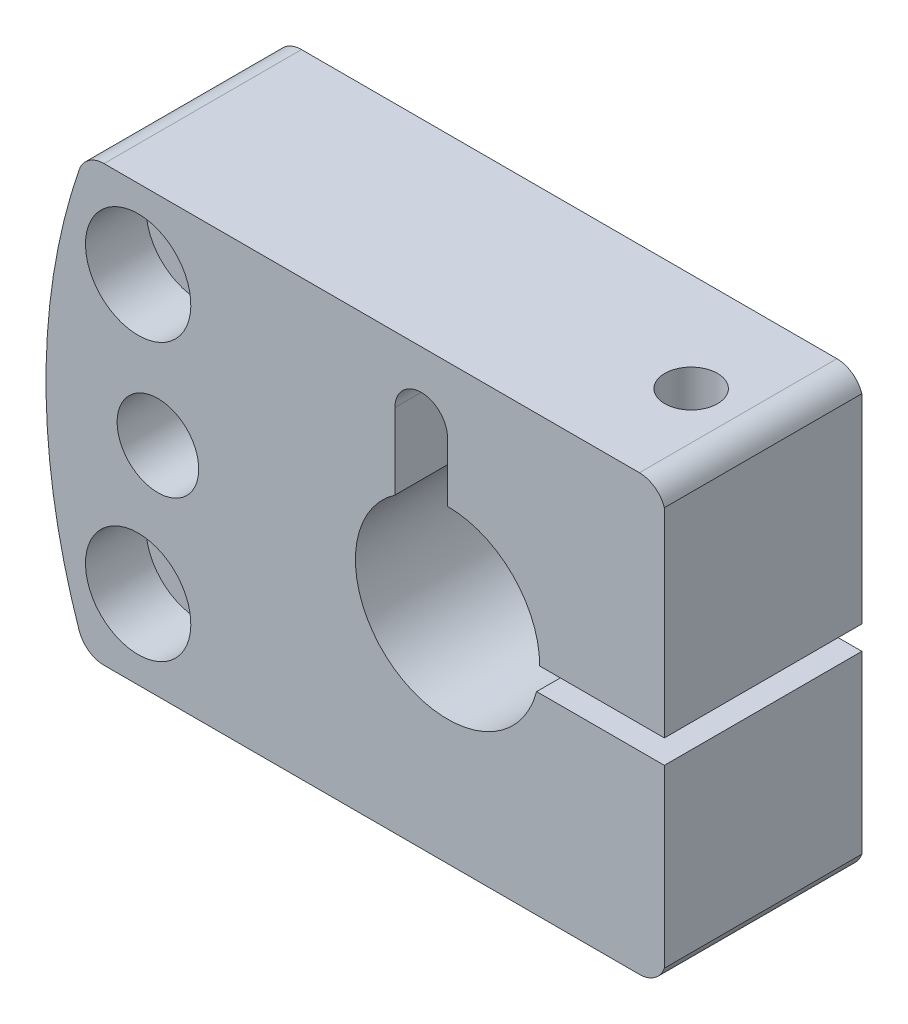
ISO-10303-21;
HEADER;
FILE_DESCRIPTION(('STEP AP214'),'2;1');
FILE_NAME('part.step','',(''),(''),'','','');
FILE_SCHEMA(('AUTOMOTIVE_DESIGN { 1 0 10303 214 1 1 1 1 }'));
ENDSEC;
DATA;
#1=APPLICATION_CONTEXT('core data for automotive mechanical design processes');
#2=APPLICATION_PROTOCOL_DEFINITION('international standard','automotive_design',2000,#1);
#3=PRODUCT_CONTEXT('',#1,'mechanical');
#4=PRODUCT('Part','Part','',(#3));
#5=PRODUCT_RELATED_PRODUCT_CATEGORY('part','',(#4));
#6=PRODUCT_DEFINITION_FORMATION('','',#4);
#7=PRODUCT_DEFINITION_CONTEXT('part definition',#1,'design');
#8=PRODUCT_DEFINITION('design','',#6,#7);
#9=PRODUCT_DEFINITION_SHAPE('','',#8);
#10=(LENGTH_UNIT() NAMED_UNIT(*) SI_UNIT(.MILLI.,.METRE.));
#11=(NAMED_UNIT(*) PLANE_ANGLE_UNIT() SI_UNIT($,.RADIAN.));
#12=(NAMED_UNIT(*) SI_UNIT($,.STERADIAN.) SOLID_ANGLE_UNIT());
#13=UNCERTAINTY_MEASURE_WITH_UNIT(LENGTH_MEASURE(1.E-05),#10,'distance_accuracy_value','');
#14=(GEOMETRIC_REPRESENTATION_CONTEXT(3) GLOBAL_UNCERTAINTY_ASSIGNED_CONTEXT((#13)) GLOBAL_UNIT_ASSIGNED_CONTEXT((#10,
#11,#12)) REPRESENTATION_CONTEXT('',''));
#15=CARTESIAN_POINT('',(0.,0.,0.));
#16=DIRECTION('',(0.,0.,1.));
#17=DIRECTION('',(1.,0.,0.));
#18=AXIS2_PLACEMENT_3D('',#15,#16,#17);
#19=CARTESIAN_POINT('',(13.0240000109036,-13.4999999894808,5.469035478));
#20=DIRECTION('',(-8.07677640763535E-10,1.,0.));
#21=DIRECTION('',(-1.,-8.07677640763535E-10,0.));
#22=AXIS2_PLACEMENT_3D('',#19,#20,#21);
#23=PLANE('',#22);
#24=CARTESIAN_POINT('',(11.0000000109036,-13.4999999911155,7.5));
#25=DIRECTION('',(-8.07677640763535E-10,1.,0.));
#26=DIRECTION('',(0.,0.,-1.));
#27=AXIS2_PLACEMENT_3D('',#24,#25,#26);
#28=CIRCLE('',#27,2.);
#29=CARTESIAN_POINT('',(11.0000000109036,-13.4999999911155,5.5));
#30=VERTEX_POINT('',#29);
#31=EDGE_CURVE('E311',#30,#30,#28,.T.);
#32=ORIENTED_EDGE('',*,*,#31,.T.);
#33=EDGE_LOOP('',(#32));
#34=FACE_BOUND('',#33,.T.);
#35=ADVANCED_FACE('F14',(#34),#23,.T.);
#36=CARTESIAN_POINT('',(-23.5000000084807,10.4999999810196,10.4));
#37=DIRECTION('',(0.,0.,-1.));
#38=DIRECTION('',(8.07677640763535E-10,-1.,0.));
#39=AXIS2_PLACEMENT_3D('',#36,#37,#38);
#40=CYLINDRICAL_SURFACE('',#39,2.25);
#41=CARTESIAN_POINT('',(-23.5000000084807,10.4999999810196,10.4));
#42=DIRECTION('',(0.,0.,-1.));
#43=DIRECTION('',(8.07677640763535E-10,-1.,0.));
#44=AXIS2_PLACEMENT_3D('',#41,#42,#43);
#45=CIRCLE('',#44,2.25);
#46=CARTESIAN_POINT('',(-23.5000000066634,8.24999998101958,10.4));
#47=VERTEX_POINT('',#46);
#48=EDGE_CURVE('E308',#47,#47,#45,.F.);
#49=ORIENTED_EDGE('',*,*,#48,.T.);
#50=EDGE_LOOP('',(#49));
#51=FACE_BOUND('',#50,.T.);
#52=CARTESIAN_POINT('',(-23.5000000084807,10.4999999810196,4.6));
#53=DIRECTION('',(0.,0.,-1.));
#54=DIRECTION('',(8.07677640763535E-10,-1.,0.));
#55=AXIS2_PLACEMENT_3D('',#52,#53,#54);
#56=CIRCLE('',#55,2.25);
#57=CARTESIAN_POINT('',(-23.5000000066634,8.24999998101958,4.6));
#58=VERTEX_POINT('',#57);
#59=EDGE_CURVE('E313',#58,#58,#56,.F.);
#60=ORIENTED_EDGE('',*,*,#59,.F.);
#61=EDGE_LOOP('',(#60));
#62=FACE_BOUND('',#61,.T.);
#63=ADVANCED_FACE('F325',(#51,#62),#40,.F.);
#64=CARTESIAN_POINT('',(-23.4999999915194,-10.5000000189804,10.4));
#65=DIRECTION('',(0.,0.,-1.));
#66=DIRECTION('',(8.07677640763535E-10,-1.,0.));
#67=AXIS2_PLACEMENT_3D('',#64,#65,#66);
#68=CYLINDRICAL_SURFACE('',#67,2.25);
#69=CARTESIAN_POINT('',(-23.4999999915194,-10.5000000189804,10.4));
#70=DIRECTION('',(0.,0.,-1.));
#71=DIRECTION('',(8.07677640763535E-10,-1.,0.));
#72=AXIS2_PLACEMENT_3D('',#69,#70,#71);
#73=CIRCLE('',#72,2.25);
#74=CARTESIAN_POINT('',(-23.4999999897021,-12.7500000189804,10.4));
#75=VERTEX_POINT('',#74);
#76=EDGE_CURVE('E305',#75,#75,#73,.T.);
#77=ORIENTED_EDGE('',*,*,#76,.F.);
#78=EDGE_LOOP('',(#77));
#79=FACE_BOUND('',#78,.T.);
#80=CARTESIAN_POINT('',(-23.4999999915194,-10.5000000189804,4.6));
#81=DIRECTION('',(0.,0.,-1.));
#82=DIRECTION('',(8.07677640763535E-10,-1.,0.));
#83=AXIS2_PLACEMENT_3D('',#80,#81,#82);
#84=CIRCLE('',#83,2.25);
#85=CARTESIAN_POINT('',(-23.4999999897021,-12.7500000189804,4.6));
#86=VERTEX_POINT('',#85);
#87=EDGE_CURVE('E18',#86,#86,#84,.F.);
#88=ORIENTED_EDGE('',*,*,#87,.F.);
#89=EDGE_LOOP('',(#88));
#90=FACE_BOUND('',#89,.T.);
#91=ADVANCED_FACE('F323',(#79,#90),#68,.F.);
#92=CARTESIAN_POINT('',(-19.4380709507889,-6.45200001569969,4.6));
#93=DIRECTION('',(0.,0.,-1.));
#94=DIRECTION('',(8.07677640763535E-10,-1.,0.));
#95=AXIS2_PLACEMENT_3D('',#92,#93,#94);
#96=PLANE('',#95);
#97=ORIENTED_EDGE('',*,*,#87,.T.);
#98=EDGE_LOOP('',(#97));
#99=FACE_BOUND('',#98,.T.);
#100=CARTESIAN_POINT('',(-23.4999999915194,-10.5000000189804,4.6));
#101=DIRECTION('',(0.,0.,-1.));
#102=DIRECTION('',(8.07677640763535E-10,-1.,0.));
#103=AXIS2_PLACEMENT_3D('',#100,#101,#102);
#104=CIRCLE('',#103,4.);
#105=CARTESIAN_POINT('',(-23.4999999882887,-14.5000000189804,4.6));
#106=VERTEX_POINT('',#105);
#107=EDGE_CURVE('E302',#106,#106,#104,.T.);
#108=ORIENTED_EDGE('',*,*,#107,.T.);
#109=EDGE_LOOP('',(#108));
#110=FACE_BOUND('',#109,.T.);
#111=ADVANCED_FACE('F320',(#99,#110),#96,.T.);
#112=CARTESIAN_POINT('',(-19.4380709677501,14.5479999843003,4.6));
#113=DIRECTION('',(0.,0.,-1.));
#114=DIRECTION('',(8.07677640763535E-10,-1.,0.));
#115=AXIS2_PLACEMENT_3D('',#112,#113,#114);
#116=PLANE('',#115);
#117=ORIENTED_EDGE('',*,*,#59,.T.);
#118=EDGE_LOOP('',(#117));
#119=FACE_BOUND('',#118,.T.);
#120=CARTESIAN_POINT('',(-23.5000000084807,10.4999999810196,4.6));
#121=DIRECTION('',(0.,0.,-1.));
#122=DIRECTION('',(8.07677640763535E-10,-1.,0.));
#123=AXIS2_PLACEMENT_3D('',#120,#121,#122);
#124=CIRCLE('',#123,4.);
#125=CARTESIAN_POINT('',(-23.5000000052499,6.49999998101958,4.6));
#126=VERTEX_POINT('',#125);
#127=EDGE_CURVE('E238',#126,#126,#124,.T.);
#128=ORIENTED_EDGE('',*,*,#127,.T.);
#129=EDGE_LOOP('',(#128));
#130=FACE_BOUND('',#129,.T.);
#131=ADVANCED_FACE('F334',(#119,#130),#116,.T.);
#132=CARTESIAN_POINT('',(11.0000000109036,-13.4999999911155,7.5));
#133=DIRECTION('',(-8.07677640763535E-10,1.,0.));
#134=DIRECTION('',(0.,0.,-1.));
#135=AXIS2_PLACEMENT_3D('',#132,#133,#134);
#136=CYLINDRICAL_SURFACE('',#135,2.);
#137=CARTESIAN_POINT('',(11.0000000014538,-1.79999999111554,7.5));
#138=DIRECTION('',(-8.07677640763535E-10,1.,0.));
#139=DIRECTION('',(0.,0.,-1.));
#140=AXIS2_PLACEMENT_3D('',#137,#138,#139);
#141=CIRCLE('',#140,2.);
#142=CARTESIAN_POINT('',(11.0000000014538,-1.79999999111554,5.5));
#143=VERTEX_POINT('',#142);
#144=EDGE_CURVE('E222',#143,#143,#141,.T.);
#145=ORIENTED_EDGE('',*,*,#144,.T.);
#146=EDGE_LOOP('',(#145));
#147=FACE_BOUND('',#146,.T.);
#148=ORIENTED_EDGE('',*,*,#31,.F.);
#149=EDGE_LOOP('',(#148));
#150=FACE_BOUND('',#149,.T.);
#151=ADVANCED_FACE('F359',(#147,#150),#136,.F.);
#152=CARTESIAN_POINT('',(11.,8.88446087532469E-09,7.5));
#153=DIRECTION('',(-8.07677640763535E-10,1.,0.));
#154=DIRECTION('',(0.,0.,-1.));
#155=AXIS2_PLACEMENT_3D('',#152,#153,#154);
#156=CYLINDRICAL_SURFACE('',#155,2.);
#157=CARTESIAN_POINT('',(11.,8.88446087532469E-09,7.5));
#158=DIRECTION('',(-8.07677640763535E-10,1.,0.));
#159=DIRECTION('',(0.,0.,-1.));
#160=AXIS2_PLACEMENT_3D('',#157,#158,#159);
#161=CIRCLE('',#160,2.);
#162=CARTESIAN_POINT('',(11.,8.88446087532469E-09,5.5));
#163=VERTEX_POINT('',#162);
#164=EDGE_CURVE('E162',#163,#163,#161,.F.);
#165=ORIENTED_EDGE('',*,*,#164,.T.);
#166=EDGE_LOOP('',(#165));
#167=FACE_BOUND('',#166,.T.);
#168=CARTESIAN_POINT('',(10.9999999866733,16.5000000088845,7.5));
#169=DIRECTION('',(-8.07677640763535E-10,1.,0.));
#170=DIRECTION('',(0.,0.,-1.));
#171=AXIS2_PLACEMENT_3D('',#168,#169,#170);
#172=CIRCLE('',#171,2.);
#173=CARTESIAN_POINT('',(10.9999999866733,16.5000000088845,5.5));
#174=VERTEX_POINT('',#173);
#175=EDGE_CURVE('E207',#174,#174,#172,.T.);
#176=ORIENTED_EDGE('',*,*,#175,.T.);
#177=EDGE_LOOP('',(#176));
#178=FACE_BOUND('',#177,.T.);
#179=ADVANCED_FACE('F364',(#167,#178),#156,.F.);
#180=CARTESIAN_POINT('',(-19.4380709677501,14.5479999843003,10.4));
#181=DIRECTION('',(0.,0.,-1.));
#182=DIRECTION('',(8.07677640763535E-10,-1.,0.));
#183=AXIS2_PLACEMENT_3D('',#180,#181,#182);
#184=PLANE('',#183);
#185=ORIENTED_EDGE('',*,*,#48,.F.);
#186=EDGE_LOOP('',(#185));
#187=FACE_BOUND('',#186,.T.);
#188=CARTESIAN_POINT('',(-23.5000000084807,10.4999999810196,10.4));
#189=DIRECTION('',(0.,0.,1.));
#190=DIRECTION('',(-8.07677640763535E-10,1.,0.));
#191=AXIS2_PLACEMENT_3D('',#188,#189,#190);
#192=CIRCLE('',#191,4.);
#193=CARTESIAN_POINT('',(-23.5000000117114,14.4999999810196,10.4));
#194=VERTEX_POINT('',#193);
#195=EDGE_CURVE('E205',#194,#194,#192,.T.);
#196=ORIENTED_EDGE('',*,*,#195,.T.);
#197=EDGE_LOOP('',(#196));
#198=FACE_BOUND('',#197,.T.);
#199=ADVANCED_FACE('F360',(#187,#198),#184,.F.);
#200=CARTESIAN_POINT('',(-19.4380709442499,-14.5480000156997,10.4));
#201=DIRECTION('',(0.,0.,1.));
#202=DIRECTION('',(-8.07677640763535E-10,1.,0.));
#203=AXIS2_PLACEMENT_3D('',#200,#201,#202);
#204=PLANE('',#203);
#205=ORIENTED_EDGE('',*,*,#76,.T.);
#206=EDGE_LOOP('',(#205));
#207=FACE_BOUND('',#206,.T.);
#208=CARTESIAN_POINT('',(-23.4999999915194,-10.5000000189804,10.4));
#209=DIRECTION('',(0.,0.,1.));
#210=DIRECTION('',(-8.07677640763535E-10,1.,0.));
#211=AXIS2_PLACEMENT_3D('',#208,#209,#210);
#212=CIRCLE('',#211,4.);
#213=CARTESIAN_POINT('',(-23.4999999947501,-6.50000001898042,10.4));
#214=VERTEX_POINT('',#213);
#215=EDGE_CURVE('E226',#214,#214,#212,.T.);
#216=ORIENTED_EDGE('',*,*,#215,.T.);
#217=EDGE_LOOP('',(#216));
#218=FACE_BOUND('',#217,.T.);
#219=ADVANCED_FACE('F363',(#207,#218),#204,.T.);
#220=CARTESIAN_POINT('',(-23.4999999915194,-10.5000000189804,4.6));
#221=DIRECTION('',(0.,0.,-1.));
#222=DIRECTION('',(8.07677640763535E-10,-1.,0.));
#223=AXIS2_PLACEMENT_3D('',#220,#221,#222);
#224=CYLINDRICAL_SURFACE('',#223,4.);
#225=ORIENTED_EDGE('',*,*,#107,.F.);
#226=EDGE_LOOP('',(#225));
#227=FACE_BOUND('',#226,.T.);
#228=CARTESIAN_POINT('',(-23.4999999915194,-10.5000000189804,0.));
#229=DIRECTION('',(0.,0.,-1.));
#230=DIRECTION('',(8.07677640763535E-10,-1.,0.));
#231=AXIS2_PLACEMENT_3D('',#228,#229,#230);
#232=CIRCLE('',#231,4.);
#233=CARTESIAN_POINT('',(-23.4999999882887,-14.5000000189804,0.));
#234=VERTEX_POINT('',#233);
#235=EDGE_CURVE('E263',#234,#234,#232,.T.);
#236=ORIENTED_EDGE('',*,*,#235,.T.);
#237=EDGE_LOOP('',(#236));
#238=FACE_BOUND('',#237,.T.);
#239=ADVANCED_FACE('F368',(#227,#238),#224,.F.);
#240=CARTESIAN_POINT('',(-23.5000000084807,10.4999999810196,4.6));
#241=DIRECTION('',(0.,0.,-1.));
#242=DIRECTION('',(8.07677640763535E-10,-1.,0.));
#243=AXIS2_PLACEMENT_3D('',#240,#241,#242);
#244=CYLINDRICAL_SURFACE('',#243,4.);
#245=ORIENTED_EDGE('',*,*,#127,.F.);
#246=EDGE_LOOP('',(#245));
#247=FACE_BOUND('',#246,.T.);
#248=CARTESIAN_POINT('',(-23.5000000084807,10.4999999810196,0.));
#249=DIRECTION('',(0.,0.,-1.));
#250=DIRECTION('',(8.07677640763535E-10,-1.,0.));
#251=AXIS2_PLACEMENT_3D('',#248,#249,#250);
#252=CIRCLE('',#251,4.);
#253=CARTESIAN_POINT('',(-23.5000000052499,6.49999998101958,0.));
#254=VERTEX_POINT('',#253);
#255=EDGE_CURVE('E260',#254,#254,#252,.T.);
#256=ORIENTED_EDGE('',*,*,#255,.T.);
#257=EDGE_LOOP('',(#256));
#258=FACE_BOUND('',#257,.T.);
#259=ADVANCED_FACE('F677',(#247,#258),#244,.F.);
#260=CARTESIAN_POINT('',(-26.0928186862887,-14.5000000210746,15.));
#261=DIRECTION('',(0.,0.,-1.));
#262=DIRECTION('',(-1.,-8.07677640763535E-10,0.));
#263=AXIS2_PLACEMENT_3D('',#260,#261,#262);
#264=CYLINDRICAL_SURFACE('',#263,2.);
#265=CARTESIAN_POINT('',(-26.0928186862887,-14.5000000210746,15.));
#266=DIRECTION('',(0.,0.,-1.));
#267=DIRECTION('',(-1.,-8.07677640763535E-10,0.));
#268=AXIS2_PLACEMENT_3D('',#265,#266,#267);
#269=CIRCLE('',#268,2.);
#270=CARTESIAN_POINT('',(-27.9855348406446,-15.1462395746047,15.));
#271=VERTEX_POINT('',#270);
#272=CARTESIAN_POINT('',(-26.0928186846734,-16.5000000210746,15.));
#273=VERTEX_POINT('',#272);
#274=EDGE_CURVE('E195',#271,#273,#269,.F.);
#275=ORIENTED_EDGE('',*,*,#274,.F.);
#276=DIRECTION('',(0.,0.,1.));
#277=VECTOR('',#276,1.);
#278=CARTESIAN_POINT('',(-27.9855348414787,-15.1462395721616,7.5));
#279=LINE('',#278,#277);
#280=CARTESIAN_POINT('',(-27.9855348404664,-15.1462395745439,0.));
#281=VERTEX_POINT('',#280);
#282=EDGE_CURVE('E200',#281,#271,#279,.T.);
#283=ORIENTED_EDGE('',*,*,#282,.F.);
#284=CARTESIAN_POINT('',(-26.0928186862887,-14.5000000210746,0.));
#285=DIRECTION('',(0.,0.,-1.));
#286=DIRECTION('',(-1.,-8.07677640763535E-10,0.));
#287=AXIS2_PLACEMENT_3D('',#284,#285,#286);
#288=CIRCLE('',#287,2.);
#289=CARTESIAN_POINT('',(-26.0928186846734,-16.5000000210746,0.));
#290=VERTEX_POINT('',#289);
#291=EDGE_CURVE('E266',#281,#290,#288,.F.);
#292=ORIENTED_EDGE('',*,*,#291,.T.);
#293=DIRECTION('',(0.,0.,1.));
#294=VECTOR('',#293,1.);
#295=CARTESIAN_POINT('',(-26.0928186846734,-16.5000000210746,7.5));
#296=LINE('',#295,#294);
#297=EDGE_CURVE('E236',#290,#273,#296,.T.);
#298=ORIENTED_EDGE('',*,*,#297,.T.);
#299=EDGE_LOOP('',(#275,#283,#292,#298));
#300=FACE_BOUND('',#299,.T.);
#301=ADVANCED_FACE('F374',(#300),#264,.T.);
#302=CARTESIAN_POINT('',(14.5727111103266,-16.49999998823,15.));
#303=DIRECTION('',(-8.07677640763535E-10,1.,0.));
#304=DIRECTION('',(0.,0.,-1.));
#305=AXIS2_PLACEMENT_3D('',#302,#303,#304);
#306=PLANE('',#305);
#307=DIRECTION('',(0.,0.,-1.));
#308=VECTOR('',#307,1.);
#309=CARTESIAN_POINT('',(14.5727111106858,-16.49999998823,7.5));
#310=LINE('',#309,#308);
#311=CARTESIAN_POINT('',(14.5727111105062,-16.49999998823,15.));
#312=VERTEX_POINT('',#311);
#313=CARTESIAN_POINT('',(14.5727111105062,-16.49999998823,0.));
#314=VERTEX_POINT('',#313);
#315=EDGE_CURVE('E119',#312,#314,#310,.T.);
#316=ORIENTED_EDGE('',*,*,#315,.F.);
#317=DIRECTION('',(1.,8.07677640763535E-10,0.));
#318=VECTOR('',#317,1.);
#319=CARTESIAN_POINT('',(-7.32027889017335,-16.5000000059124,15.));
#320=LINE('',#319,#318);
#321=EDGE_CURVE('E193',#273,#312,#320,.T.);
#322=ORIENTED_EDGE('',*,*,#321,.F.);
#323=ORIENTED_EDGE('',*,*,#297,.F.);
#324=DIRECTION('',(1.,8.07677640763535E-10,0.));
#325=VECTOR('',#324,1.);
#326=CARTESIAN_POINT('',(-7.32027889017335,-16.5000000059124,0.));
#327=LINE('',#326,#325);
#328=EDGE_CURVE('E225',#290,#314,#327,.T.);
#329=ORIENTED_EDGE('',*,*,#328,.T.);
#330=EDGE_LOOP('',(#316,#322,#323,#329));
#331=FACE_BOUND('',#330,.T.);
#332=ADVANCED_FACE('F370',(#331),#306,.F.);
#333=CARTESIAN_POINT('',(14.5727111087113,-14.4999999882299,15.));
#334=DIRECTION('',(0.,0.,-1.));
#335=DIRECTION('',(-1.,-8.07677640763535E-10,0.));
#336=AXIS2_PLACEMENT_3D('',#333,#334,#335);
#337=CYLINDRICAL_SURFACE('',#336,2.);
#338=CARTESIAN_POINT('',(14.5727111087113,-14.4999999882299,15.));
#339=DIRECTION('',(0.,0.,-1.));
#340=DIRECTION('',(-1.,-8.07677640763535E-10,0.));
#341=AXIS2_PLACEMENT_3D('',#338,#339,#340);
#342=CIRCLE('',#341,2.);
#343=CARTESIAN_POINT('',(16.4654272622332,-15.1462395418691,15.));
#344=VERTEX_POINT('',#343);
#345=EDGE_CURVE('E190',#312,#344,#342,.F.);
#346=ORIENTED_EDGE('',*,*,#345,.F.);
#347=ORIENTED_EDGE('',*,*,#315,.T.);
#348=CARTESIAN_POINT('',(14.5727111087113,-14.4999999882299,0.));
#349=DIRECTION('',(0.,0.,-1.));
#350=DIRECTION('',(-1.,-8.07677640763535E-10,0.));
#351=AXIS2_PLACEMENT_3D('',#348,#349,#350);
#352=CIRCLE('',#351,2.);
#353=CARTESIAN_POINT('',(16.4654272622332,-15.1462395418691,0.));
#354=VERTEX_POINT('',#353);
#355=EDGE_CURVE('E287',#314,#354,#352,.F.);
#356=ORIENTED_EDGE('',*,*,#355,.T.);
#357=DIRECTION('',(0.,0.,1.));
#358=VECTOR('',#357,1.);
#359=CARTESIAN_POINT('',(16.4654272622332,-15.1462395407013,7.5));
#360=LINE('',#359,#358);
#361=EDGE_CURVE('E126',#354,#344,#360,.T.);
#362=ORIENTED_EDGE('',*,*,#361,.T.);
#363=EDGE_LOOP('',(#346,#347,#356,#362));
#364=FACE_BOUND('',#363,.T.);
#365=ADVANCED_FACE('F373',(#364),#337,.T.);
#366=CARTESIAN_POINT('',(16.4654272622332,-15.1462395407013,0.));
#367=DIRECTION('',(-1.,-8.07677640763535E-10,0.));
#368=DIRECTION('',(0.,0.,1.));
#369=AXIS2_PLACEMENT_3D('',#366,#367,#368);
#370=PLANE('',#369);
#371=DIRECTION('',(0.,0.,1.));
#372=VECTOR('',#371,1.);
#373=CARTESIAN_POINT('',(16.4654272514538,-1.79999998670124,7.5));
#374=LINE('',#373,#372);
#375=CARTESIAN_POINT('',(16.4654272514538,-1.79999999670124,0.));
#376=VERTEX_POINT('',#375);
#377=CARTESIAN_POINT('',(16.4654272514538,-1.79999999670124,15.));
#378=VERTEX_POINT('',#377);
#379=EDGE_CURVE('E133',#376,#378,#374,.T.);
#380=ORIENTED_EDGE('',*,*,#379,.T.);
#381=DIRECTION('',(-8.07677640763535E-10,1.,0.));
#382=VECTOR('',#381,1.);
#383=CARTESIAN_POINT('',(16.46542725,1.32987596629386E-08,15.));
#384=LINE('',#383,#382);
#385=EDGE_CURVE('E186',#344,#378,#384,.T.);
#386=ORIENTED_EDGE('',*,*,#385,.F.);
#387=ORIENTED_EDGE('',*,*,#361,.F.);
#388=DIRECTION('',(-8.07677640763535E-10,1.,0.));
#389=VECTOR('',#388,1.);
#390=CARTESIAN_POINT('',(16.46542725,1.32987596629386E-08,0.));
#391=LINE('',#390,#389);
#392=EDGE_CURVE('E289',#354,#376,#391,.T.);
#393=ORIENTED_EDGE('',*,*,#392,.T.);
#394=EDGE_LOOP('',(#380,#386,#387,#393));
#395=FACE_BOUND('',#394,.T.);
#396=ADVANCED_FACE('F376',(#395),#370,.F.);
#397=CARTESIAN_POINT('',(16.4654272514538,-1.79999998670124,0.));
#398=DIRECTION('',(8.07677640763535E-10,-1.,0.));
#399=DIRECTION('',(0.,0.,1.));
#400=AXIS2_PLACEMENT_3D('',#397,#398,#399);
#401=PLANE('',#400);
#402=ORIENTED_EDGE('',*,*,#144,.F.);
#403=EDGE_LOOP('',(#402));
#404=FACE_BOUND('',#403,.T.);
#405=DIRECTION('',(0.,0.,1.));
#406=VECTOR('',#405,1.);
#407=CARTESIAN_POINT('',(6.76461381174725,-1.79999999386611,7.5));
#408=LINE('',#407,#406);
#409=CARTESIAN_POINT('',(6.7646138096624,-1.80000000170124,0.));
#410=VERTEX_POINT('',#409);
#411=CARTESIAN_POINT('',(6.7646138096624,-1.80000000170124,15.));
#412=VERTEX_POINT('',#411);
#413=EDGE_CURVE('E227',#410,#412,#408,.T.);
#414=ORIENTED_EDGE('',*,*,#413,.T.);
#415=DIRECTION('',(-1.,-8.07677640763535E-10,0.));
#416=VECTOR('',#415,1.);
#417=CARTESIAN_POINT('',(-7.3202789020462,-1.80000002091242,15.));
#418=LINE('',#417,#416);
#419=EDGE_CURVE('E183',#378,#412,#418,.T.);
#420=ORIENTED_EDGE('',*,*,#419,.F.);
#421=ORIENTED_EDGE('',*,*,#379,.F.);
#422=DIRECTION('',(-1.,-8.07677640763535E-10,0.));
#423=VECTOR('',#422,1.);
#424=CARTESIAN_POINT('',(-7.3202789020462,-1.80000002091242,0.));
#425=LINE('',#424,#423);
#426=EDGE_CURVE('E439',#376,#410,#425,.T.);
#427=ORIENTED_EDGE('',*,*,#426,.T.);
#428=EDGE_LOOP('',(#414,#420,#421,#427));
#429=FACE_BOUND('',#428,.T.);
#430=ADVANCED_FACE('F379',(#404,#429),#401,.F.);
#431=CARTESIAN_POINT('',(-2.0000000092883,11.4999999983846,15.));
#432=DIRECTION('',(0.,0.,-1.));
#433=DIRECTION('',(-1.,-8.07677640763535E-10,0.));
#434=AXIS2_PLACEMENT_3D('',#431,#432,#433);
#435=CYLINDRICAL_SURFACE('',#434,2.);
#436=DIRECTION('',(0.,0.,1.));
#437=VECTOR('',#436,1.);
#438=CARTESIAN_POINT('',(-9.28829929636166E-09,11.5,7.5));
#439=LINE('',#438,#437);
#440=CARTESIAN_POINT('',(-1.6921700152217E-08,11.5,0.));
#441=VERTEX_POINT('',#440);
#442=CARTESIAN_POINT('',(-1.6921700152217E-08,11.5,15.));
#443=VERTEX_POINT('',#442);
#444=EDGE_CURVE('E219',#441,#443,#439,.T.);
#445=ORIENTED_EDGE('',*,*,#444,.T.);
#446=CARTESIAN_POINT('',(-2.0000000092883,11.4999999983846,15.));
#447=DIRECTION('',(0.,0.,-1.));
#448=DIRECTION('',(-1.,-8.07677640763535E-10,0.));
#449=AXIS2_PLACEMENT_3D('',#446,#447,#448);
#450=CIRCLE('',#449,2.);
#451=CARTESIAN_POINT('',(-4.00000002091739,11.4999999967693,15.));
#452=VERTEX_POINT('',#451);
#453=EDGE_CURVE('E179',#452,#443,#450,.T.);
#454=ORIENTED_EDGE('',*,*,#453,.F.);
#455=DIRECTION('',(0.,0.,-1.));
#456=VECTOR('',#455,1.);
#457=CARTESIAN_POINT('',(-4.0000000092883,11.4999999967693,7.5));
#458=LINE('',#457,#456);
#459=CARTESIAN_POINT('',(-4.00000002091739,11.4999999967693,0.));
#460=VERTEX_POINT('',#459);
#461=EDGE_CURVE('E223',#452,#460,#458,.T.);
#462=ORIENTED_EDGE('',*,*,#461,.T.);
#463=CARTESIAN_POINT('',(-2.0000000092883,11.4999999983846,0.));
#464=DIRECTION('',(0.,0.,-1.));
#465=DIRECTION('',(-1.,-8.07677640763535E-10,0.));
#466=AXIS2_PLACEMENT_3D('',#463,#464,#465);
#467=CIRCLE('',#466,2.);
#468=EDGE_CURVE('E284',#460,#441,#467,.T.);
#469=ORIENTED_EDGE('',*,*,#468,.T.);
#470=EDGE_LOOP('',(#445,#454,#462,#469));
#471=FACE_BOUND('',#470,.T.);
#472=ADVANCED_FACE('F382',(#471),#435,.F.);
#473=CARTESIAN_POINT('',(-5.65374830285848E-09,7.,15.));
#474=DIRECTION('',(1.,8.07677640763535E-10,0.));
#475=DIRECTION('',(0.,0.,-1.));
#476=AXIS2_PLACEMENT_3D('',#473,#474,#475);
#477=PLANE('',#476);
#478=DIRECTION('',(0.,0.,1.));
#479=VECTOR('',#478,1.);
#480=CARTESIAN_POINT('',(-2.78229869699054E-09,7.,7.5));
#481=LINE('',#480,#479);
#482=CARTESIAN_POINT('',(-1.1851450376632E-08,7.,0.));
#483=VERTEX_POINT('',#482);
#484=CARTESIAN_POINT('',(-1.1851450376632E-08,7.,15.));
#485=VERTEX_POINT('',#484);
#486=EDGE_CURVE('E216',#483,#485,#481,.T.);
#487=ORIENTED_EDGE('',*,*,#486,.T.);
#488=DIRECTION('',(8.07677640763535E-10,-1.,0.));
#489=VECTOR('',#488,1.);
#490=CARTESIAN_POINT('',(-1.52668502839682E-08,0.,15.));
#491=LINE('',#490,#489);
#492=EDGE_CURVE('E177',#443,#485,#491,.T.);
#493=ORIENTED_EDGE('',*,*,#492,.F.);
#494=ORIENTED_EDGE('',*,*,#444,.F.);
#495=DIRECTION('',(8.07677640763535E-10,-1.,0.));
#496=VECTOR('',#495,1.);
#497=CARTESIAN_POINT('',(-1.52668502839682E-08,0.,0.));
#498=LINE('',#497,#496);
#499=EDGE_CURVE('E283',#441,#483,#498,.T.);
#500=ORIENTED_EDGE('',*,*,#499,.T.);
#501=EDGE_LOOP('',(#487,#493,#494,#500));
#502=FACE_BOUND('',#501,.T.);
#503=ADVANCED_FACE('F384',(#502),#477,.F.);
#504=CARTESIAN_POINT('',(0.,0.,15.));
#505=DIRECTION('',(0.,0.,-1.));
#506=DIRECTION('',(-1.,-8.07677640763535E-10,0.));
#507=AXIS2_PLACEMENT_3D('',#504,#505,#506);
#508=CYLINDRICAL_SURFACE('',#507,7.);
#509=DIRECTION('',(0.,0.,1.));
#510=VECTOR('',#509,1.);
#511=CARTESIAN_POINT('',(7.,5.6537396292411E-09,7.5));
#512=LINE('',#511,#510);
#513=CARTESIAN_POINT('',(7.,5.6537396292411E-09,0.));
#514=VERTEX_POINT('',#513);
#515=CARTESIAN_POINT('',(7.,5.6537396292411E-09,15.));
#516=VERTEX_POINT('',#515);
#517=EDGE_CURVE('E214',#514,#516,#512,.T.);
#518=ORIENTED_EDGE('',*,*,#517,.T.);
#519=CARTESIAN_POINT('',(0.,0.,15.));
#520=DIRECTION('',(0.,0.,-1.));
#521=DIRECTION('',(-1.,-8.07677640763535E-10,0.));
#522=AXIS2_PLACEMENT_3D('',#519,#520,#521);
#523=CIRCLE('',#522,7.);
#524=EDGE_CURVE('E149',#485,#516,#523,.T.);
#525=ORIENTED_EDGE('',*,*,#524,.F.);
#526=ORIENTED_EDGE('',*,*,#486,.F.);
#527=CARTESIAN_POINT('',(0.,0.,0.));
#528=DIRECTION('',(0.,0.,-1.));
#529=DIRECTION('',(-1.,-8.07677640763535E-10,0.));
#530=AXIS2_PLACEMENT_3D('',#527,#528,#529);
#531=CIRCLE('',#530,7.);
#532=EDGE_CURVE('E280',#483,#514,#531,.T.);
#533=ORIENTED_EDGE('',*,*,#532,.T.);
#534=EDGE_LOOP('',(#518,#525,#526,#533));
#535=FACE_BOUND('',#534,.T.);
#536=ADVANCED_FACE('F387',(#535),#508,.F.);
#537=CARTESIAN_POINT('',(16.46542725,1.32987596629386E-08,15.));
#538=DIRECTION('',(-8.07677640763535E-10,1.,0.));
#539=DIRECTION('',(0.,0.,-1.));
#540=AXIS2_PLACEMENT_3D('',#537,#538,#539);
#541=PLANE('',#540);
#542=ORIENTED_EDGE('',*,*,#164,.F.);
#543=EDGE_LOOP('',(#542));
#544=FACE_BOUND('',#543,.T.);
#545=DIRECTION('',(0.,0.,1.));
#546=VECTOR('',#545,1.);
#547=CARTESIAN_POINT('',(16.46542725,1.32987596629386E-08,7.5));
#548=LINE('',#547,#546);
#549=CARTESIAN_POINT('',(16.46542725,1.32987596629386E-08,0.));
#550=VERTEX_POINT('',#549);
#551=CARTESIAN_POINT('',(16.46542725,1.32987596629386E-08,15.));
#552=VERTEX_POINT('',#551);
#553=EDGE_CURVE('E154',#550,#552,#548,.T.);
#554=ORIENTED_EDGE('',*,*,#553,.T.);
#555=DIRECTION('',(1.,8.07677640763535E-10,0.));
#556=VECTOR('',#555,1.);
#557=CARTESIAN_POINT('',(-7.3202789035,-5.91241985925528E-09,15.));
#558=LINE('',#557,#556);
#559=EDGE_CURVE('E143',#516,#552,#558,.T.);
#560=ORIENTED_EDGE('',*,*,#559,.F.);
#561=ORIENTED_EDGE('',*,*,#517,.F.);
#562=DIRECTION('',(1.,8.07677640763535E-10,0.));
#563=VECTOR('',#562,1.);
#564=CARTESIAN_POINT('',(-7.3202789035,-5.91241985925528E-09,0.));
#565=LINE('',#564,#563);
#566=EDGE_CURVE('E157',#514,#550,#565,.T.);
#567=ORIENTED_EDGE('',*,*,#566,.T.);
#568=EDGE_LOOP('',(#554,#560,#561,#567));
#569=FACE_BOUND('',#568,.T.);
#570=ADVANCED_FACE('F155',(#544,#569),#541,.F.);
#571=CARTESIAN_POINT('',(16.4654272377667,15.1462395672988,0.));
#572=DIRECTION('',(-1.,-8.07677640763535E-10,0.));
#573=DIRECTION('',(8.07677640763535E-10,-1.,0.));
#574=AXIS2_PLACEMENT_3D('',#571,#572,#573);
#575=PLANE('',#574);
#576=DIRECTION('',(0.,0.,-1.));
#577=VECTOR('',#576,1.);
#578=CARTESIAN_POINT('',(16.4654272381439,15.1462395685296,7.5));
#579=LINE('',#578,#577);
#580=CARTESIAN_POINT('',(16.4654272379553,15.146239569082,15.));
#581=VERTEX_POINT('',#580);
#582=CARTESIAN_POINT('',(16.4654272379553,15.146239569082,0.));
#583=VERTEX_POINT('',#582);
#584=EDGE_CURVE('E161',#581,#583,#579,.T.);
#585=ORIENTED_EDGE('',*,*,#584,.F.);
#586=DIRECTION('',(-8.07677640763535E-10,1.,0.));
#587=VECTOR('',#586,1.);
#588=CARTESIAN_POINT('',(16.46542725,1.32987596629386E-08,15.));
#589=LINE('',#588,#587);
#590=EDGE_CURVE('E146',#552,#581,#589,.T.);
#591=ORIENTED_EDGE('',*,*,#590,.F.);
#592=ORIENTED_EDGE('',*,*,#553,.F.);
#593=DIRECTION('',(-8.07677640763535E-10,1.,0.));
#594=VECTOR('',#593,1.);
#595=CARTESIAN_POINT('',(16.46542725,1.32987596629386E-08,0.));
#596=LINE('',#595,#594);
#597=EDGE_CURVE('E279',#550,#583,#596,.T.);
#598=ORIENTED_EDGE('',*,*,#597,.T.);
#599=EDGE_LOOP('',(#585,#591,#592,#598));
#600=FACE_BOUND('',#599,.T.);
#601=ADVANCED_FACE('F164',(#600),#575,.F.);
#602=CARTESIAN_POINT('',(14.5727110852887,14.5000000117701,15.));
#603=DIRECTION('',(0.,0.,-1.));
#604=DIRECTION('',(-1.,-8.07677640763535E-10,0.));
#605=AXIS2_PLACEMENT_3D('',#602,#603,#604);
#606=CYLINDRICAL_SURFACE('',#605,2.);
#607=CARTESIAN_POINT('',(14.5727110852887,14.5000000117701,15.));
#608=DIRECTION('',(0.,0.,-1.));
#609=DIRECTION('',(-1.,-8.07677640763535E-10,0.));
#610=AXIS2_PLACEMENT_3D('',#607,#608,#609);
#611=CIRCLE('',#610,2.);
#612=CARTESIAN_POINT('',(14.5727110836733,16.5000000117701,15.));
#613=VERTEX_POINT('',#612);
#614=EDGE_CURVE('E166',#581,#613,#611,.F.);
#615=ORIENTED_EDGE('',*,*,#614,.F.);
#616=ORIENTED_EDGE('',*,*,#584,.T.);
#617=CARTESIAN_POINT('',(14.5727110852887,14.5000000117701,0.));
#618=DIRECTION('',(0.,0.,-1.));
#619=DIRECTION('',(-1.,-8.07677640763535E-10,0.));
#620=AXIS2_PLACEMENT_3D('',#617,#618,#619);
#621=CIRCLE('',#620,2.);
#622=CARTESIAN_POINT('',(14.5727110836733,16.5000000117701,0.));
#623=VERTEX_POINT('',#622);
#624=EDGE_CURVE('E276',#583,#623,#621,.F.);
#625=ORIENTED_EDGE('',*,*,#624,.T.);
#626=DIRECTION('',(0.,0.,1.));
#627=VECTOR('',#626,1.);
#628=CARTESIAN_POINT('',(14.5727110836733,16.5000000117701,7.5));
#629=LINE('',#628,#627);
#630=EDGE_CURVE('E208',#623,#613,#629,.T.);
#631=ORIENTED_EDGE('',*,*,#630,.T.);
#632=EDGE_LOOP('',(#615,#616,#625,#631));
#633=FACE_BOUND('',#632,.T.);
#634=ADVANCED_FACE('F394',(#633),#606,.T.);
#635=CARTESIAN_POINT('',(-26.0928187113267,16.4999999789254,0.));
#636=DIRECTION('',(8.07677640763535E-10,-1.,0.));
#637=DIRECTION('',(1.,8.07677640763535E-10,0.));
#638=AXIS2_PLACEMENT_3D('',#635,#636,#637);
#639=PLANE('',#638);
#640=ORIENTED_EDGE('',*,*,#175,.F.);
#641=EDGE_LOOP('',(#640));
#642=FACE_BOUND('',#641,.T.);
#643=DIRECTION('',(0.,0.,-1.));
#644=VECTOR('',#643,1.);
#645=CARTESIAN_POINT('',(-26.0928187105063,16.4999999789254,7.5));
#646=LINE('',#645,#644);
#647=CARTESIAN_POINT('',(-26.0928187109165,16.4999999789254,15.));
#648=VERTEX_POINT('',#647);
#649=CARTESIAN_POINT('',(-26.0928187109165,16.4999999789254,0.));
#650=VERTEX_POINT('',#649);
#651=EDGE_CURVE('E203',#648,#650,#646,.T.);
#652=ORIENTED_EDGE('',*,*,#651,.F.);
#653=DIRECTION('',(-1.,-8.07677640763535E-10,0.));
#654=VECTOR('',#653,1.);
#655=CARTESIAN_POINT('',(-7.3202789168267,16.4999999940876,15.));
#656=LINE('',#655,#654);
#657=EDGE_CURVE('E168',#613,#648,#656,.T.);
#658=ORIENTED_EDGE('',*,*,#657,.F.);
#659=ORIENTED_EDGE('',*,*,#630,.F.);
#660=DIRECTION('',(-1.,-8.07677640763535E-10,0.));
#661=VECTOR('',#660,1.);
#662=CARTESIAN_POINT('',(-7.3202789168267,16.4999999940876,0.));
#663=LINE('',#662,#661);
#664=EDGE_CURVE('E275',#623,#650,#663,.T.);
#665=ORIENTED_EDGE('',*,*,#664,.T.);
#666=EDGE_LOOP('',(#652,#658,#659,#665));
#667=FACE_BOUND('',#666,.T.);
#668=ADVANCED_FACE('F395',(#642,#667),#639,.F.);
#669=CARTESIAN_POINT('',(-26.0928187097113,14.4999999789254,15.));
#670=DIRECTION('',(0.,0.,-1.));
#671=DIRECTION('',(-1.,-8.07677640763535E-10,0.));
#672=AXIS2_PLACEMENT_3D('',#669,#670,#671);
#673=CYLINDRICAL_SURFACE('',#672,2.);
#674=CARTESIAN_POINT('',(-26.0928187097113,14.4999999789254,15.));
#675=DIRECTION('',(0.,0.,-1.));
#676=DIRECTION('',(-1.,-8.07677640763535E-10,0.));
#677=AXIS2_PLACEMENT_3D('',#674,#675,#676);
#678=CIRCLE('',#677,2.);
#679=CARTESIAN_POINT('',(-27.9855348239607,15.1462396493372,15.));
#680=VERTEX_POINT('',#679);
#681=EDGE_CURVE('E252',#648,#680,#678,.F.);
#682=ORIENTED_EDGE('',*,*,#681,.F.);
#683=ORIENTED_EDGE('',*,*,#651,.T.);
#684=CARTESIAN_POINT('',(-26.0928187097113,14.4999999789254,0.));
#685=DIRECTION('',(0.,0.,-1.));
#686=DIRECTION('',(-1.,-8.07677640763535E-10,0.));
#687=AXIS2_PLACEMENT_3D('',#684,#685,#686);
#688=CIRCLE('',#687,2.);
#689=CARTESIAN_POINT('',(-27.985534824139,15.146239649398,0.));
#690=VERTEX_POINT('',#689);
#691=EDGE_CURVE('E272',#650,#690,#688,.F.);
#692=ORIENTED_EDGE('',*,*,#691,.T.);
#693=DIRECTION('',(0.,0.,-1.));
#694=VECTOR('',#693,1.);
#695=CARTESIAN_POINT('',(-27.985534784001,15.1462397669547,7.5));
#696=LINE('',#695,#694);
#697=EDGE_CURVE('E202',#680,#690,#696,.T.);
#698=ORIENTED_EDGE('',*,*,#697,.F.);
#699=EDGE_LOOP('',(#682,#683,#692,#698));
#700=FACE_BOUND('',#699,.T.);
#701=ADVANCED_FACE('F398',(#700),#673,.T.);
#702=CARTESIAN_POINT('',(16.375,1.32257191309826E-08,15.));
#703=DIRECTION('',(0.,0.,-1.));
#704=DIRECTION('',(-1.,-8.07677640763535E-10,0.));
#705=AXIS2_PLACEMENT_3D('',#702,#703,#704);
#706=CYLINDRICAL_SURFACE('',#705,46.875);
#707=CARTESIAN_POINT('',(16.375,1.32257191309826E-08,15.));
#708=DIRECTION('',(0.,0.,-1.));
#709=DIRECTION('',(-1.,-8.07677640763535E-10,0.));
#710=AXIS2_PLACEMENT_3D('',#707,#708,#709);
#711=CIRCLE('',#710,46.875);
#712=EDGE_CURVE('E249',#680,#271,#711,.F.);
#713=ORIENTED_EDGE('',*,*,#712,.F.);
#714=ORIENTED_EDGE('',*,*,#697,.T.);
#715=CARTESIAN_POINT('',(16.375,1.32257191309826E-08,0.));
#716=DIRECTION('',(0.,0.,-1.));
#717=DIRECTION('',(-1.,-8.07677640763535E-10,0.));
#718=AXIS2_PLACEMENT_3D('',#715,#716,#717);
#719=CIRCLE('',#718,46.875);
#720=EDGE_CURVE('E269',#690,#281,#719,.F.);
#721=ORIENTED_EDGE('',*,*,#720,.T.);
#722=ORIENTED_EDGE('',*,*,#282,.T.);
#723=EDGE_LOOP('',(#713,#714,#721,#722));
#724=FACE_BOUND('',#723,.T.);
#725=ADVANCED_FACE('F449',(#724),#706,.T.);
#726=CARTESIAN_POINT('',(-23.5000000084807,10.4999999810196,10.4));
#727=DIRECTION('',(0.,0.,1.));
#728=DIRECTION('',(-8.07677640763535E-10,1.,0.));
#729=AXIS2_PLACEMENT_3D('',#726,#727,#728);
#730=CYLINDRICAL_SURFACE('',#729,4.);
#731=CARTESIAN_POINT('',(-23.5000000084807,10.4999999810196,15.));
#732=DIRECTION('',(0.,0.,1.));
#733=DIRECTION('',(-8.07677640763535E-10,1.,0.));
#734=AXIS2_PLACEMENT_3D('',#731,#732,#733);
#735=CIRCLE('',#734,4.);
#736=CARTESIAN_POINT('',(-23.5000000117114,14.4999999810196,15.));
#737=VERTEX_POINT('',#736);
#738=EDGE_CURVE('E246',#737,#737,#735,.F.);
#739=ORIENTED_EDGE('',*,*,#738,.F.);
#740=EDGE_LOOP('',(#739));
#741=FACE_BOUND('',#740,.T.);
#742=ORIENTED_EDGE('',*,*,#195,.F.);
#743=EDGE_LOOP('',(#742));
#744=FACE_BOUND('',#743,.T.);
#745=ADVANCED_FACE('F477',(#741,#744),#730,.F.);
#746=CARTESIAN_POINT('',(-23.4999999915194,-10.5000000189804,10.4));
#747=DIRECTION('',(0.,0.,1.));
#748=DIRECTION('',(-8.07677640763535E-10,1.,0.));
#749=AXIS2_PLACEMENT_3D('',#746,#747,#748);
#750=CYLINDRICAL_SURFACE('',#749,4.);
#751=CARTESIAN_POINT('',(-23.4999999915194,-10.5000000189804,15.));
#752=DIRECTION('',(0.,0.,1.));
#753=DIRECTION('',(-8.07677640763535E-10,1.,0.));
#754=AXIS2_PLACEMENT_3D('',#751,#752,#753);
#755=CIRCLE('',#754,4.);
#756=CARTESIAN_POINT('',(-23.4999999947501,-6.50000001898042,15.));
#757=VERTEX_POINT('',#756);
#758=EDGE_CURVE('E243',#757,#757,#755,.F.);
#759=ORIENTED_EDGE('',*,*,#758,.F.);
#760=EDGE_LOOP('',(#759));
#761=FACE_BOUND('',#760,.T.);
#762=ORIENTED_EDGE('',*,*,#215,.F.);
#763=EDGE_LOOP('',(#762));
#764=FACE_BOUND('',#763,.T.);
#765=ADVANCED_FACE('F479',(#761,#764),#750,.F.);
#766=CARTESIAN_POINT('',(-22.,-1.77688991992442E-08,15.));
#767=DIRECTION('',(0.,0.,-1.));
#768=DIRECTION('',(-1.,-8.07677640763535E-10,0.));
#769=AXIS2_PLACEMENT_3D('',#766,#767,#768);
#770=CYLINDRICAL_SURFACE('',#769,3.1);
#771=CARTESIAN_POINT('',(-22.,-1.77688991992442E-08,15.));
#772=DIRECTION('',(0.,0.,-1.));
#773=DIRECTION('',(-1.,-8.07677640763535E-10,0.));
#774=AXIS2_PLACEMENT_3D('',#771,#772,#773);
#775=CIRCLE('',#774,3.1);
#776=CARTESIAN_POINT('',(-25.1,-2.02726998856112E-08,15.));
#777=VERTEX_POINT('',#776);
#778=EDGE_CURVE('E199',#777,#777,#775,.T.);
#779=ORIENTED_EDGE('',*,*,#778,.F.);
#780=EDGE_LOOP('',(#779));
#781=FACE_BOUND('',#780,.T.);
#782=CARTESIAN_POINT('',(-22.,-1.77688991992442E-08,0.));
#783=DIRECTION('',(0.,0.,-1.));
#784=DIRECTION('',(-1.,-8.07677640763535E-10,0.));
#785=AXIS2_PLACEMENT_3D('',#782,#783,#784);
#786=CIRCLE('',#785,3.1);
#787=CARTESIAN_POINT('',(-25.1,-2.02726998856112E-08,0.));
#788=VERTEX_POINT('',#787);
#789=EDGE_CURVE('E230',#788,#788,#786,.T.);
#790=ORIENTED_EDGE('',*,*,#789,.T.);
#791=EDGE_LOOP('',(#790));
#792=FACE_BOUND('',#791,.T.);
#793=ADVANCED_FACE('F352',(#781,#792),#770,.F.);
#794=CARTESIAN_POINT('',(-4.00000000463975,5.74456264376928,0.));
#795=DIRECTION('',(-1.,-8.07677640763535E-10,0.));
#796=DIRECTION('',(0.,0.,1.));
#797=AXIS2_PLACEMENT_3D('',#794,#795,#796);
#798=PLANE('',#797);
#799=ORIENTED_EDGE('',*,*,#461,.F.);
#800=DIRECTION('',(-8.07677640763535E-10,1.,0.));
#801=VECTOR('',#800,1.);
#802=CARTESIAN_POINT('',(-4.0000000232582,-3.23070042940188E-09,15.));
#803=LINE('',#802,#801);
#804=CARTESIAN_POINT('',(-4.00000001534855,5.74456263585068,15.));
#805=VERTEX_POINT('',#804);
#806=EDGE_CURVE('E180',#805,#452,#803,.T.);
#807=ORIENTED_EDGE('',*,*,#806,.F.);
#808=DIRECTION('',(0.,0.,-1.));
#809=VECTOR('',#808,1.);
#810=CARTESIAN_POINT('',(-4.0000000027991,5.74456264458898,7.5));
#811=LINE('',#810,#809);
#812=CARTESIAN_POINT('',(-4.00000001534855,5.74456263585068,0.));
#813=VERTEX_POINT('',#812);
#814=EDGE_CURVE('E196',#805,#813,#811,.T.);
#815=ORIENTED_EDGE('',*,*,#814,.T.);
#816=DIRECTION('',(-8.07677640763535E-10,1.,0.));
#817=VECTOR('',#816,1.);
#818=CARTESIAN_POINT('',(-4.0000000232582,-3.23070042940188E-09,0.));
#819=LINE('',#818,#817);
#820=EDGE_CURVE('E33',#813,#460,#819,.T.);
#821=ORIENTED_EDGE('',*,*,#820,.T.);
#822=EDGE_LOOP('',(#799,#807,#815,#821));
#823=FACE_BOUND('',#822,.T.);
#824=ADVANCED_FACE('F400',(#823),#798,.F.);
#825=CARTESIAN_POINT('',(16.4654272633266,-16.4999999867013,0.));
#826=DIRECTION('',(0.,0.,1.));
#827=DIRECTION('',(-8.07677640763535E-10,1.,0.));
#828=AXIS2_PLACEMENT_3D('',#825,#826,#827);
#829=PLANE('',#828);
#830=ORIENTED_EDGE('',*,*,#789,.F.);
#831=EDGE_LOOP('',(#830));
#832=FACE_BOUND('',#831,.T.);
#833=ORIENTED_EDGE('',*,*,#255,.F.);
#834=EDGE_LOOP('',(#833));
#835=FACE_BOUND('',#834,.T.);
#836=ORIENTED_EDGE('',*,*,#235,.F.);
#837=EDGE_LOOP('',(#836));
#838=FACE_BOUND('',#837,.T.);
#839=ORIENTED_EDGE('',*,*,#720,.F.);
#840=ORIENTED_EDGE('',*,*,#691,.F.);
#841=ORIENTED_EDGE('',*,*,#664,.F.);
#842=ORIENTED_EDGE('',*,*,#624,.F.);
#843=ORIENTED_EDGE('',*,*,#597,.F.);
#844=ORIENTED_EDGE('',*,*,#566,.F.);
#845=ORIENTED_EDGE('',*,*,#532,.F.);
#846=ORIENTED_EDGE('',*,*,#499,.F.);
#847=ORIENTED_EDGE('',*,*,#468,.F.);
#848=ORIENTED_EDGE('',*,*,#820,.F.);
#849=CARTESIAN_POINT('',(0.,0.,0.));
#850=DIRECTION('',(0.,0.,-1.));
#851=DIRECTION('',(-1.,-8.07677640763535E-10,0.));
#852=AXIS2_PLACEMENT_3D('',#849,#850,#851);
#853=CIRCLE('',#852,7.);
#854=EDGE_CURVE('E24',#813,#410,#853,.F.);
#855=ORIENTED_EDGE('',*,*,#854,.T.);
#856=ORIENTED_EDGE('',*,*,#426,.F.);
#857=ORIENTED_EDGE('',*,*,#392,.F.);
#858=ORIENTED_EDGE('',*,*,#355,.F.);
#859=ORIENTED_EDGE('',*,*,#328,.F.);
#860=ORIENTED_EDGE('',*,*,#291,.F.);
#861=EDGE_LOOP('',(#839,#840,#841,#842,#843,#844,#845,#846,#847,#848,#855,#856,#857,#858,#859,#860));
#862=FACE_BOUND('',#861,.T.);
#863=ADVANCED_FACE('F348',(#832,#835,#838,#862),#829,.F.);
#864=CARTESIAN_POINT('',(16.4654272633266,-16.4999999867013,15.));
#865=DIRECTION('',(0.,0.,1.));
#866=DIRECTION('',(-8.07677640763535E-10,1.,0.));
#867=AXIS2_PLACEMENT_3D('',#864,#865,#866);
#868=PLANE('',#867);
#869=ORIENTED_EDGE('',*,*,#778,.T.);
#870=EDGE_LOOP('',(#869));
#871=FACE_BOUND('',#870,.T.);
#872=ORIENTED_EDGE('',*,*,#758,.T.);
#873=EDGE_LOOP('',(#872));
#874=FACE_BOUND('',#873,.T.);
#875=ORIENTED_EDGE('',*,*,#738,.T.);
#876=EDGE_LOOP('',(#875));
#877=FACE_BOUND('',#876,.T.);
#878=ORIENTED_EDGE('',*,*,#681,.T.);
#879=ORIENTED_EDGE('',*,*,#712,.T.);
#880=ORIENTED_EDGE('',*,*,#274,.T.);
#881=ORIENTED_EDGE('',*,*,#321,.T.);
#882=ORIENTED_EDGE('',*,*,#345,.T.);
#883=ORIENTED_EDGE('',*,*,#385,.T.);
#884=ORIENTED_EDGE('',*,*,#419,.T.);
#885=CARTESIAN_POINT('',(0.,0.,15.));
#886=DIRECTION('',(0.,0.,-1.));
#887=DIRECTION('',(-1.,-8.07677640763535E-10,0.));
#888=AXIS2_PLACEMENT_3D('',#885,#886,#887);
#889=CIRCLE('',#888,7.);
#890=EDGE_CURVE('E9',#412,#805,#889,.T.);
#891=ORIENTED_EDGE('',*,*,#890,.T.);
#892=ORIENTED_EDGE('',*,*,#806,.T.);
#893=ORIENTED_EDGE('',*,*,#453,.T.);
#894=ORIENTED_EDGE('',*,*,#492,.T.);
#895=ORIENTED_EDGE('',*,*,#524,.T.);
#896=ORIENTED_EDGE('',*,*,#559,.T.);
#897=ORIENTED_EDGE('',*,*,#590,.T.);
#898=ORIENTED_EDGE('',*,*,#614,.T.);
#899=ORIENTED_EDGE('',*,*,#657,.T.);
#900=EDGE_LOOP('',(#878,#879,#880,#881,#882,#883,#884,#891,#892,#893,#894,#895,#896,#897,#898,#899));
#901=FACE_BOUND('',#900,.T.);
#902=ADVANCED_FACE('F16',(#871,#874,#877,#901),#868,.T.);
#903=CARTESIAN_POINT('',(0.,0.,15.));
#904=DIRECTION('',(0.,0.,-1.));
#905=DIRECTION('',(-1.,-8.07677640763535E-10,0.));
#906=AXIS2_PLACEMENT_3D('',#903,#904,#905);
#907=CYLINDRICAL_SURFACE('',#906,7.);
#908=ORIENTED_EDGE('',*,*,#890,.F.);
#909=ORIENTED_EDGE('',*,*,#413,.F.);
#910=ORIENTED_EDGE('',*,*,#854,.F.);
#911=ORIENTED_EDGE('',*,*,#814,.F.);
#912=EDGE_LOOP('',(#908,#909,#910,#911));
#913=FACE_BOUND('',#912,.T.);
#914=ADVANCED_FACE('F340',(#913),#907,.F.);
#915=CLOSED_SHELL('',(#35,#63,#91,#111,#131,#151,#179,#199,#219,#239,#259,#301,#332,#365,#396,
#430,#472,#503,#536,#570,#601,#634,#668,#701,#725,#745,#765,#793,#824,#863,#902,#914));
#916=MANIFOLD_SOLID_BREP('B1',#915);
#917=ADVANCED_BREP_SHAPE_REPRESENTATION('',(#18,#916),#14);
#918=SHAPE_DEFINITION_REPRESENTATION(#9,#917);
ENDSEC;
END-ISO-10303-21;
